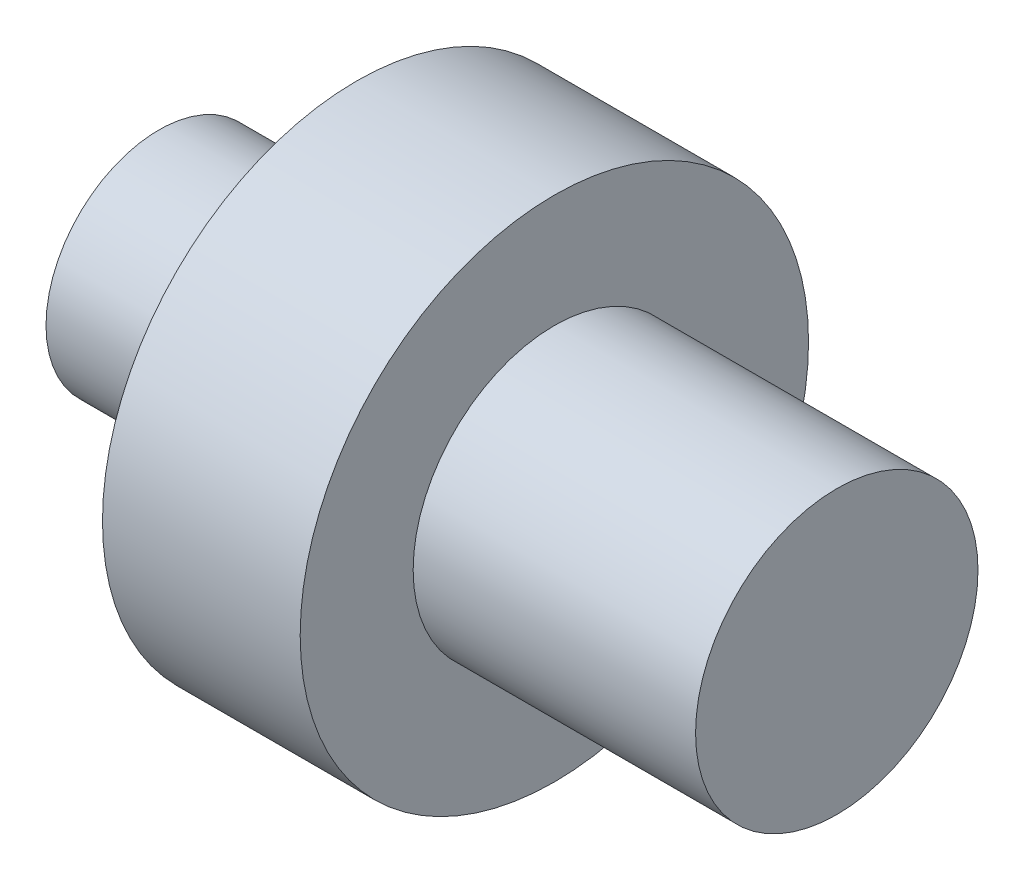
from build123d import *

# Parameters (mm, degrees)
SKETCH_1_R      = 20
EXTRUDE_1_DEPTH = 40
SKETCH_2_R      = 36
EXTRUDE_2_DEPTH = 28
SKETCH_3_R      = 16
EXTRUDE_3_DEPTH = 28


with BuildPart() as part:
    # Sketch 1 → Extrude 1 (new body)
    with BuildSketch(Plane(origin=(0, 0, 0), x_dir=(0, 0, -1), z_dir=(1, 0, 0))):
        Circle(SKETCH_1_R)
    extrude(amount=-EXTRUDE_1_DEPTH)

    # Sketch 2 → Extrude 2 (add)
    with BuildSketch(Plane.ZY.offset(40)):
        Circle(SKETCH_2_R)
    extrude(amount=EXTRUDE_2_DEPTH)

    # Sketch 3 → Extrude 3 (add)
    with BuildSketch(Plane.ZY.offset(68)):
        Circle(SKETCH_3_R)
    extrude(amount=EXTRUDE_3_DEPTH)


solid = part.part
